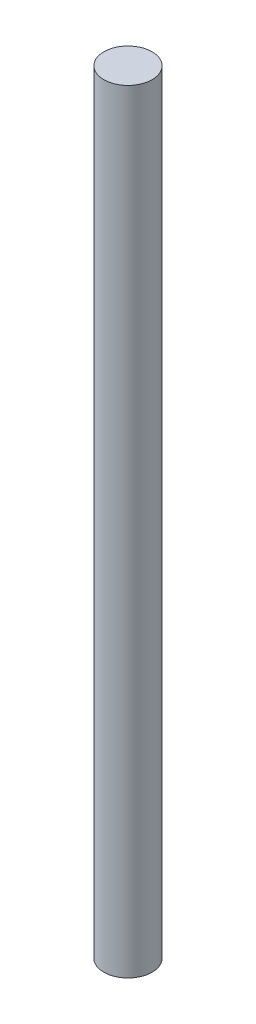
from build123d import *

# Parameters (mm, degrees)
SKETCH1_R           = 1.5875
BOSS_EXTRUDE1_DEPTH = 50.8


with BuildPart() as part:
    # Sketch1 → Boss-Extrude1 (new body)
    with BuildSketch(Plane(origin=(0, 0, 0), x_dir=(1, 0, 0), z_dir=(0, 1, 0))):
        with Locations(Location((0, 0, 0), (0, 0, 270))):
            Circle(SKETCH1_R)
    extrude(amount=BOSS_EXTRUDE1_DEPTH)


solid = part.part
